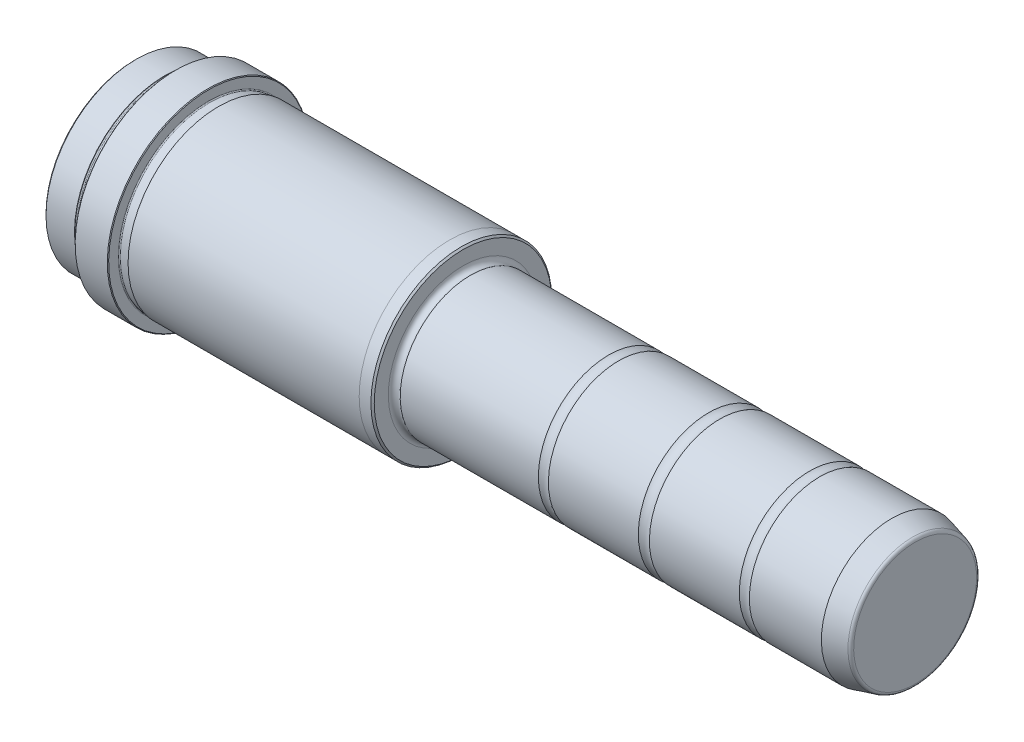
from build123d import *

# Parameters (mm, degrees)
FILLET1_R     = 1
CHAMFER1_SIZE = 0.2
CHAMFER2_SIZE = 0.5


with BuildPart() as part:
    # Sketch1 → Revolve1 (revolve)
    with BuildSketch(Plane.XY):
        with BuildLine():
            Line((135, 19.124355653), (128, 21))
            Line((128, 21), (2.248331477, 21))
            ThreePointArc((2.248331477, 21), (0.749166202, 21.001443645), (0, 22.3))
            Line((0, 22.3), (0, 27))
            Line((0, 27), (-4, 27))
            Line((-4, 27), (-73, 27.0001))
            Line((-73, 27.0001), (-73, 26.9))
            ThreePointArc((-73, 26.9), (-73.087867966, 26.687867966), (-73.3, 26.6))
            Line((-73.3, 26.6), (-75.7, 26.6))
            ThreePointArc((-75.7, 26.6), (-75.912132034, 26.687867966), (-76, 26.9))
            Line((-76, 26.9), (-76, 30))
            Line((-76, 30), (-86, 30))
            Line((-86, 30), (-86, 26.9))
            ThreePointArc((-86, 26.9), (-86.087867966, 26.687867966), (-86.3, 26.6))
            Line((-86.3, 26.6), (-88.7, 26.6))
            ThreePointArc((-88.7, 26.6), (-88.912132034, 26.687867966), (-89, 26.9))
            Line((-89, 26.9), (-89, 27))
            Line((-89, 27), (-98, 27))
            Line((-98, 27), (-98, 0))
            Line((-98, 0), (135, 0))
            Line((135, 0), (135, 19.124355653))
        make_face()
    revolve(axis=Axis((135, 0, 0), (-1, 0, 0)))

    # Sketch2 → Groove A (revolve, cut)
    with BuildSketch(Plane.XY):
        with BuildLine():
            Line((103.503337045, 21), (106.496662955, 21))
            ThreePointArc((106.496662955, 21), (105, 20.6), (103.503337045, 21))
        make_face()
    revolve(axis=Axis((135, 0, 0), (1, 0, 0)), mode=Mode.SUBTRACT)

    # Sketch3 → Groove B (revolve, cut)
    with BuildSketch(Plane.XY, mode=Mode.PRIVATE) as groove_b_sk:
        with BuildLine():
            Line((73.341687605, 21), (76.658312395, 21))
            ThreePointArc((76.658312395, 21), (75, 20.5), (73.341687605, 21))
        make_face()
    revolve(groove_b_sk.sketch.rotate(Axis((135, 0, 0), (1, 0, 0)), 180), axis=Axis((135, 0, 0), (1, 0, 0)), mode=Mode.SUBTRACT)

    # Sketch4 → Groove C (revolve, cut)
    with BuildSketch(Plane.XY, mode=Mode.PRIVATE) as groove_c_sk:
        with BuildLine():
            Line((43.503337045, 21), (46.496662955, 21))
            ThreePointArc((46.496662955, 21), (45, 20.6), (43.503337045, 21))
        make_face()
    revolve(groove_c_sk.sketch.rotate(Axis((135, 0, 0), (1, 0, 0)), 180), axis=Axis((135, 0, 0), (1, 0, 0)), mode=Mode.SUBTRACT)

    # Fillet1
    fillet1_edges = [part.edges().sort_by_distance(p)[0] for p in [
        (135, -19.124355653, 0),
    ]]
    fillet(fillet1_edges, radius=FILLET1_R)

    # Chamfer1
    chamfer1_edges = [part.edges().sort_by_distance(p)[0] for p in [
        (-76, -30, 0),
        (-86, -30, 0),
    ]]
    chamfer(chamfer1_edges, length=CHAMFER1_SIZE)

    # Chamfer2
    chamfer2_edges = [part.edges().sort_by_distance(p)[0] for p in [
        (0, -27, 0),
        (-98, -27, 0),
    ]]
    chamfer(chamfer2_edges, length=CHAMFER2_SIZE)


solid = part.part
